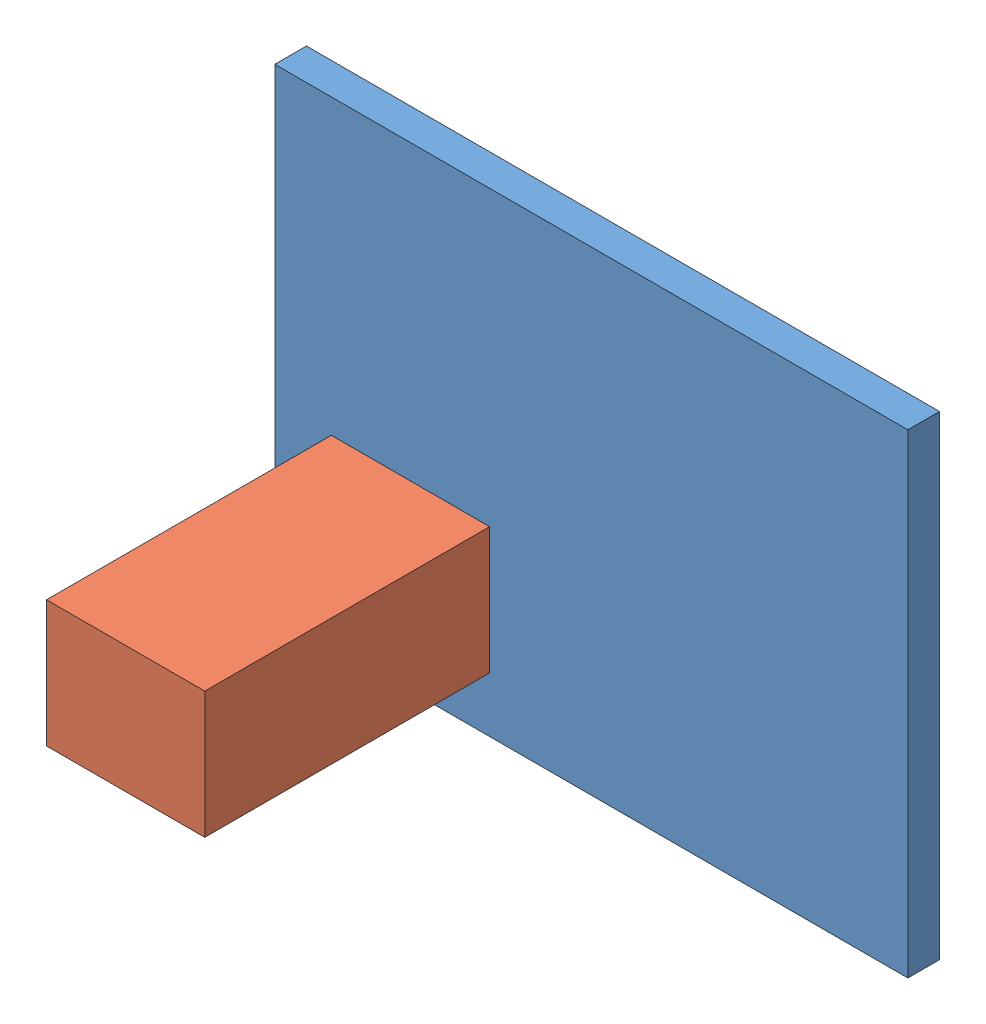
SolidWorks assembly bg_abg_skizze.SLDASM, configuration Standard (file format 4100). Lengths in mm.
Overall size (100 75 50).
2 component instances, 2 part files, 4 mates.
Components (placement in the parent):
- platte-1: platte.SLDPRT [Standard] at origin size (100 75 5)
- quader-1: quader.SLDPRT [Standard] at (8.934 -66.289 5) x (1 0 0) z (0 1 0) size (25 45 20)
Mates (geometry in assembly coordinates):
- Deckungsgleich1: coincident aligned: plane of platte-1 through (0 0 0) normal (0 0 1); plane of assembly
- Deckungsgleich2: coincident aligned: plane of platte-1 through (0 0 0) normal (1 0 0); plane of assembly
- Deckungsgleich3: coincident aligned: plane of platte-1 through (0 0 0) normal (0 1 0); plane of assembly
- Deckungsgleich4: coincident anti-aligned: plane of platte-1 through (0 -75 5) normal (0 0 1); plane of quader-1 through (8.934 -46.289 5) normal (0 0 -1)
